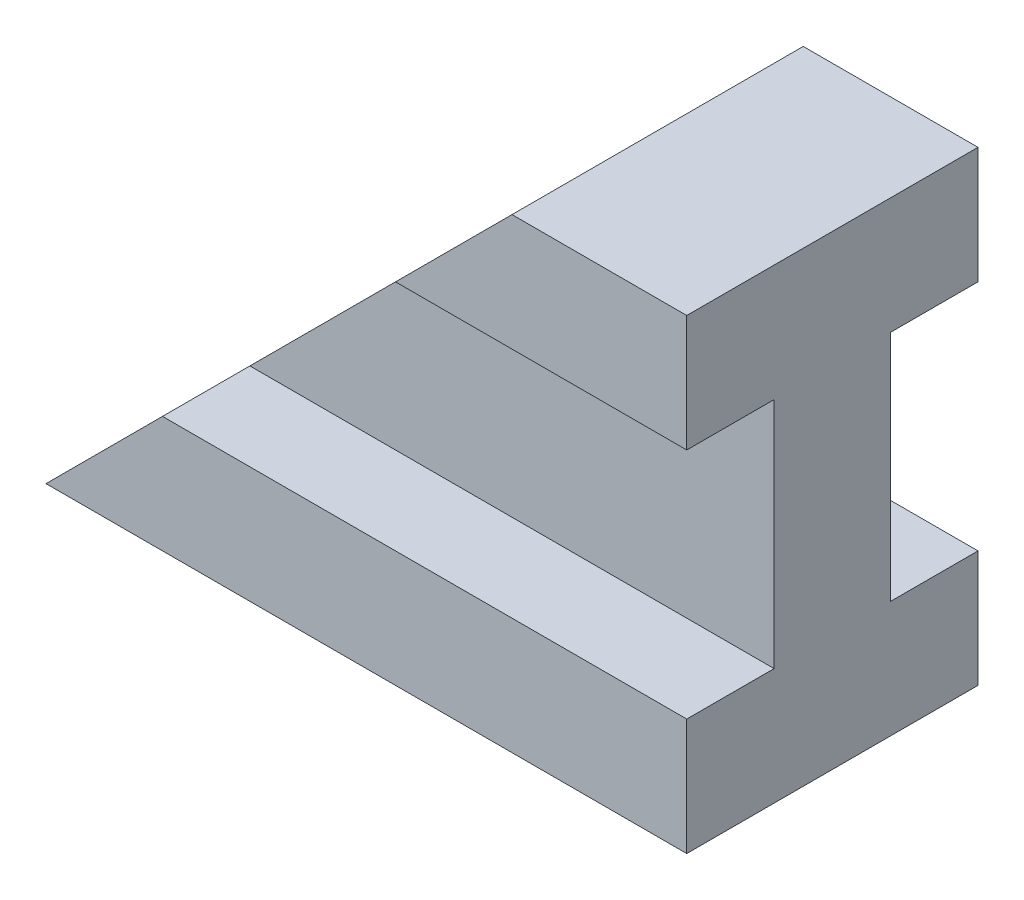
ISO-10303-21;
HEADER;
FILE_DESCRIPTION(('STEP AP214'),'2;1');
FILE_NAME('part.step','',(''),(''),'','','');
FILE_SCHEMA(('AUTOMOTIVE_DESIGN { 1 0 10303 214 1 1 1 1 }'));
ENDSEC;
DATA;
#1=APPLICATION_CONTEXT('core data for automotive mechanical design processes');
#2=APPLICATION_PROTOCOL_DEFINITION('international standard','automotive_design',2000,#1);
#3=PRODUCT_CONTEXT('',#1,'mechanical');
#4=PRODUCT('Part','Part','',(#3));
#5=PRODUCT_RELATED_PRODUCT_CATEGORY('part','',(#4));
#6=PRODUCT_DEFINITION_FORMATION('','',#4);
#7=PRODUCT_DEFINITION_CONTEXT('part definition',#1,'design');
#8=PRODUCT_DEFINITION('design','',#6,#7);
#9=PRODUCT_DEFINITION_SHAPE('','',#8);
#10=(LENGTH_UNIT() NAMED_UNIT(*) SI_UNIT(.MILLI.,.METRE.));
#11=(NAMED_UNIT(*) PLANE_ANGLE_UNIT() SI_UNIT($,.RADIAN.));
#12=(NAMED_UNIT(*) SI_UNIT($,.STERADIAN.) SOLID_ANGLE_UNIT());
#13=UNCERTAINTY_MEASURE_WITH_UNIT(LENGTH_MEASURE(1.E-05),#10,'distance_accuracy_value','');
#14=(GEOMETRIC_REPRESENTATION_CONTEXT(3) GLOBAL_UNCERTAINTY_ASSIGNED_CONTEXT((#13)) GLOBAL_UNIT_ASSIGNED_CONTEXT((#10,
#11,#12)) REPRESENTATION_CONTEXT('',''));
#15=CARTESIAN_POINT('',(0.,0.,0.));
#16=DIRECTION('',(0.,0.,1.));
#17=DIRECTION('',(1.,0.,0.));
#18=AXIS2_PLACEMENT_3D('',#15,#16,#17);
#19=CARTESIAN_POINT('',(110.,110.,0.));
#20=DIRECTION('',(0.,0.,-1.));
#21=DIRECTION('',(-1.,0.,0.));
#22=AXIS2_PLACEMENT_3D('',#19,#20,#21);
#23=PLANE('',#22);
#24=DIRECTION('',(1.,0.,0.));
#25=VECTOR('',#24,1.);
#26=CARTESIAN_POINT('',(110.,60.,0.));
#27=LINE('',#26,#25);
#28=CARTESIAN_POINT('',(60.,60.,0.));
#29=VERTEX_POINT('',#28);
#30=CARTESIAN_POINT('',(110.,60.,0.));
#31=VERTEX_POINT('',#30);
#32=EDGE_CURVE('E11',#29,#31,#27,.T.);
#33=ORIENTED_EDGE('',*,*,#32,.F.);
#34=DIRECTION('',(-0.707106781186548,-0.707106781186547,0.));
#35=VECTOR('',#34,1.);
#36=CARTESIAN_POINT('',(80.,80.,0.));
#37=LINE('',#36,#35);
#38=CARTESIAN_POINT('',(80.,80.,0.));
#39=VERTEX_POINT('',#38);
#40=EDGE_CURVE('E184',#39,#29,#37,.T.);
#41=ORIENTED_EDGE('',*,*,#40,.F.);
#42=DIRECTION('',(-1.,0.,0.));
#43=VECTOR('',#42,1.);
#44=CARTESIAN_POINT('',(110.,80.,0.));
#45=LINE('',#44,#43);
#46=CARTESIAN_POINT('',(110.,80.,0.));
#47=VERTEX_POINT('',#46);
#48=EDGE_CURVE('E192',#47,#39,#45,.T.);
#49=ORIENTED_EDGE('',*,*,#48,.F.);
#50=DIRECTION('',(0.,1.,0.));
#51=VECTOR('',#50,1.);
#52=CARTESIAN_POINT('',(110.,0.,0.));
#53=LINE('',#52,#51);
#54=EDGE_CURVE('E189',#31,#47,#53,.T.);
#55=ORIENTED_EDGE('',*,*,#54,.F.);
#56=EDGE_LOOP('',(#33,#41,#49,#55));
#57=FACE_BOUND('',#56,.T.);
#58=ADVANCED_FACE('F31',(#57),#23,.T.);
#59=CARTESIAN_POINT('',(110.,110.,50.));
#60=DIRECTION('',(0.,0.,-1.));
#61=DIRECTION('',(-1.,0.,0.));
#62=AXIS2_PLACEMENT_3D('',#59,#60,#61);
#63=PLANE('',#62);
#64=DIRECTION('',(-0.707106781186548,-0.707106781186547,0.));
#65=VECTOR('',#64,1.);
#66=CARTESIAN_POINT('',(80.,80.,50.));
#67=LINE('',#66,#65);
#68=CARTESIAN_POINT('',(80.,80.,50.));
#69=VERTEX_POINT('',#68);
#70=CARTESIAN_POINT('',(60.,60.,50.));
#71=VERTEX_POINT('',#70);
#72=EDGE_CURVE('E171',#69,#71,#67,.T.);
#73=ORIENTED_EDGE('',*,*,#72,.T.);
#74=DIRECTION('',(1.,0.,0.));
#75=VECTOR('',#74,1.);
#76=CARTESIAN_POINT('',(110.,60.,50.));
#77=LINE('',#76,#75);
#78=CARTESIAN_POINT('',(110.,60.,50.));
#79=VERTEX_POINT('',#78);
#80=EDGE_CURVE('E207',#71,#79,#77,.T.);
#81=ORIENTED_EDGE('',*,*,#80,.T.);
#82=DIRECTION('',(0.,1.,0.));
#83=VECTOR('',#82,1.);
#84=CARTESIAN_POINT('',(110.,0.,50.));
#85=LINE('',#84,#83);
#86=CARTESIAN_POINT('',(110.,80.,50.));
#87=VERTEX_POINT('',#86);
#88=EDGE_CURVE('E177',#79,#87,#85,.T.);
#89=ORIENTED_EDGE('',*,*,#88,.T.);
#90=DIRECTION('',(-1.,0.,0.));
#91=VECTOR('',#90,1.);
#92=CARTESIAN_POINT('',(110.,80.,50.));
#93=LINE('',#92,#91);
#94=EDGE_CURVE('E181',#87,#69,#93,.T.);
#95=ORIENTED_EDGE('',*,*,#94,.T.);
#96=EDGE_LOOP('',(#73,#81,#89,#95));
#97=FACE_BOUND('',#96,.T.);
#98=ADVANCED_FACE('F236',(#97),#63,.F.);
#99=CARTESIAN_POINT('',(80.,80.,50.));
#100=DIRECTION('',(0.707106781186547,-0.707106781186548,0.));
#101=DIRECTION('',(0.707106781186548,0.707106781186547,0.));
#102=AXIS2_PLACEMENT_3D('',#99,#100,#101);
#103=PLANE('',#102);
#104=ORIENTED_EDGE('',*,*,#40,.T.);
#105=DIRECTION('',(0.,0.,1.));
#106=VECTOR('',#105,1.);
#107=CARTESIAN_POINT('',(60.,60.,50.));
#108=LINE('',#107,#106);
#109=CARTESIAN_POINT('',(60.,60.,15.));
#110=VERTEX_POINT('',#109);
#111=EDGE_CURVE('E148',#29,#110,#108,.T.);
#112=ORIENTED_EDGE('',*,*,#111,.T.);
#113=DIRECTION('',(-0.707106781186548,-0.707106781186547,0.));
#114=VECTOR('',#113,1.);
#115=CARTESIAN_POINT('',(80.,80.,15.));
#116=LINE('',#115,#114);
#117=CARTESIAN_POINT('',(20.,20.,15.));
#118=VERTEX_POINT('',#117);
#119=EDGE_CURVE('E127',#110,#118,#116,.T.);
#120=ORIENTED_EDGE('',*,*,#119,.T.);
#121=DIRECTION('',(0.,0.,-1.));
#122=VECTOR('',#121,1.);
#123=CARTESIAN_POINT('',(20.,20.,50.));
#124=LINE('',#123,#122);
#125=CARTESIAN_POINT('',(20.,20.,0.));
#126=VERTEX_POINT('',#125);
#127=EDGE_CURVE('E144',#118,#126,#124,.T.);
#128=ORIENTED_EDGE('',*,*,#127,.T.);
#129=CARTESIAN_POINT('',(0.,0.,0.));
#130=VERTEX_POINT('',#129);
#131=EDGE_CURVE('E170',#126,#130,#37,.T.);
#132=ORIENTED_EDGE('',*,*,#131,.T.);
#133=DIRECTION('',(0.,0.,-1.));
#134=VECTOR('',#133,1.);
#135=CARTESIAN_POINT('',(0.,0.,50.));
#136=LINE('',#135,#134);
#137=CARTESIAN_POINT('',(0.,0.,50.));
#138=VERTEX_POINT('',#137);
#139=EDGE_CURVE('E202',#138,#130,#136,.T.);
#140=ORIENTED_EDGE('',*,*,#139,.F.);
#141=CARTESIAN_POINT('',(20.,20.,50.));
#142=VERTEX_POINT('',#141);
#143=EDGE_CURVE('E175',#142,#138,#67,.T.);
#144=ORIENTED_EDGE('',*,*,#143,.F.);
#145=DIRECTION('',(0.,0.,-1.));
#146=VECTOR('',#145,1.);
#147=CARTESIAN_POINT('',(20.,20.,50.));
#148=LINE('',#147,#146);
#149=CARTESIAN_POINT('',(20.,20.,35.));
#150=VERTEX_POINT('',#149);
#151=EDGE_CURVE('E54',#142,#150,#148,.T.);
#152=ORIENTED_EDGE('',*,*,#151,.T.);
#153=DIRECTION('',(0.707106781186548,0.707106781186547,0.));
#154=VECTOR('',#153,1.);
#155=CARTESIAN_POINT('',(80.,80.,35.));
#156=LINE('',#155,#154);
#157=CARTESIAN_POINT('',(60.,60.,35.));
#158=VERTEX_POINT('',#157);
#159=EDGE_CURVE('E167',#150,#158,#156,.T.);
#160=ORIENTED_EDGE('',*,*,#159,.T.);
#161=DIRECTION('',(0.,0.,1.));
#162=VECTOR('',#161,1.);
#163=CARTESIAN_POINT('',(60.,60.,50.));
#164=LINE('',#163,#162);
#165=EDGE_CURVE('E164',#158,#71,#164,.T.);
#166=ORIENTED_EDGE('',*,*,#165,.T.);
#167=ORIENTED_EDGE('',*,*,#72,.F.);
#168=DIRECTION('',(0.,0.,-1.));
#169=VECTOR('',#168,1.);
#170=CARTESIAN_POINT('',(80.,80.,50.));
#171=LINE('',#170,#169);
#172=EDGE_CURVE('E183',#69,#39,#171,.T.);
#173=ORIENTED_EDGE('',*,*,#172,.T.);
#174=EDGE_LOOP('',(#104,#112,#120,#128,#132,#140,#144,#152,#160,#166,#167,#173));
#175=FACE_BOUND('',#174,.T.);
#176=ADVANCED_FACE('F33',(#175),#103,.F.);
#177=CARTESIAN_POINT('',(0.,0.,50.));
#178=DIRECTION('',(0.,1.,0.));
#179=DIRECTION('',(0.,0.,1.));
#180=AXIS2_PLACEMENT_3D('',#177,#178,#179);
#181=PLANE('',#180);
#182=DIRECTION('',(1.,0.,0.));
#183=VECTOR('',#182,1.);
#184=CARTESIAN_POINT('',(0.,0.,0.));
#185=LINE('',#184,#183);
#186=CARTESIAN_POINT('',(110.,0.,0.));
#187=VERTEX_POINT('',#186);
#188=EDGE_CURVE('E187',#130,#187,#185,.T.);
#189=ORIENTED_EDGE('',*,*,#188,.T.);
#190=DIRECTION('',(0.,0.,-1.));
#191=VECTOR('',#190,1.);
#192=CARTESIAN_POINT('',(110.,0.,50.));
#193=LINE('',#192,#191);
#194=CARTESIAN_POINT('',(110.,0.,50.));
#195=VERTEX_POINT('',#194);
#196=EDGE_CURVE('E199',#195,#187,#193,.T.);
#197=ORIENTED_EDGE('',*,*,#196,.F.);
#198=DIRECTION('',(1.,0.,0.));
#199=VECTOR('',#198,1.);
#200=CARTESIAN_POINT('',(0.,0.,50.));
#201=LINE('',#200,#199);
#202=EDGE_CURVE('E174',#138,#195,#201,.T.);
#203=ORIENTED_EDGE('',*,*,#202,.F.);
#204=ORIENTED_EDGE('',*,*,#139,.T.);
#205=EDGE_LOOP('',(#189,#197,#203,#204));
#206=FACE_BOUND('',#205,.T.);
#207=ADVANCED_FACE('F220',(#206),#181,.F.);
#208=CARTESIAN_POINT('',(110.,0.,50.));
#209=DIRECTION('',(-1.,0.,0.));
#210=DIRECTION('',(0.,0.,1.));
#211=AXIS2_PLACEMENT_3D('',#208,#209,#210);
#212=PLANE('',#211);
#213=DIRECTION('',(0.,-1.,0.));
#214=VECTOR('',#213,1.);
#215=CARTESIAN_POINT('',(110.,60.,15.));
#216=LINE('',#215,#214);
#217=CARTESIAN_POINT('',(110.,60.,15.));
#218=VERTEX_POINT('',#217);
#219=CARTESIAN_POINT('',(110.,20.,15.));
#220=VERTEX_POINT('',#219);
#221=EDGE_CURVE('E125',#218,#220,#216,.T.);
#222=ORIENTED_EDGE('',*,*,#221,.F.);
#223=DIRECTION('',(0.,0.,1.));
#224=VECTOR('',#223,1.);
#225=CARTESIAN_POINT('',(110.,60.,0.));
#226=LINE('',#225,#224);
#227=EDGE_CURVE('E133',#31,#218,#226,.T.);
#228=ORIENTED_EDGE('',*,*,#227,.F.);
#229=ORIENTED_EDGE('',*,*,#54,.T.);
#230=DIRECTION('',(0.,0.,-1.));
#231=VECTOR('',#230,1.);
#232=CARTESIAN_POINT('',(110.,80.,50.));
#233=LINE('',#232,#231);
#234=EDGE_CURVE('E196',#87,#47,#233,.T.);
#235=ORIENTED_EDGE('',*,*,#234,.F.);
#236=ORIENTED_EDGE('',*,*,#88,.F.);
#237=DIRECTION('',(0.,0.,1.));
#238=VECTOR('',#237,1.);
#239=CARTESIAN_POINT('',(110.,60.,50.));
#240=LINE('',#239,#238);
#241=CARTESIAN_POINT('',(110.,60.,35.));
#242=VERTEX_POINT('',#241);
#243=EDGE_CURVE('E157',#242,#79,#240,.T.);
#244=ORIENTED_EDGE('',*,*,#243,.F.);
#245=DIRECTION('',(0.,1.,0.));
#246=VECTOR('',#245,1.);
#247=CARTESIAN_POINT('',(110.,60.,35.));
#248=LINE('',#247,#246);
#249=CARTESIAN_POINT('',(110.,20.,35.));
#250=VERTEX_POINT('',#249);
#251=EDGE_CURVE('E154',#250,#242,#248,.T.);
#252=ORIENTED_EDGE('',*,*,#251,.F.);
#253=DIRECTION('',(0.,0.,-1.));
#254=VECTOR('',#253,1.);
#255=CARTESIAN_POINT('',(110.,20.,50.));
#256=LINE('',#255,#254);
#257=CARTESIAN_POINT('',(110.,20.,50.));
#258=VERTEX_POINT('',#257);
#259=EDGE_CURVE('E151',#258,#250,#256,.T.);
#260=ORIENTED_EDGE('',*,*,#259,.F.);
#261=EDGE_CURVE('E178',#195,#258,#85,.T.);
#262=ORIENTED_EDGE('',*,*,#261,.F.);
#263=ORIENTED_EDGE('',*,*,#196,.T.);
#264=CARTESIAN_POINT('',(110.,20.,0.));
#265=VERTEX_POINT('',#264);
#266=EDGE_CURVE('E190',#187,#265,#53,.T.);
#267=ORIENTED_EDGE('',*,*,#266,.T.);
#268=DIRECTION('',(0.,0.,-1.));
#269=VECTOR('',#268,1.);
#270=CARTESIAN_POINT('',(110.,20.,0.));
#271=LINE('',#270,#269);
#272=EDGE_CURVE('E46',#220,#265,#271,.T.);
#273=ORIENTED_EDGE('',*,*,#272,.F.);
#274=EDGE_LOOP('',(#222,#228,#229,#235,#236,#244,#252,#260,#262,#263,#267,#273));
#275=FACE_BOUND('',#274,.T.);
#276=ADVANCED_FACE('F139',(#275),#212,.F.);
#277=CARTESIAN_POINT('',(110.,80.,50.));
#278=DIRECTION('',(0.,-1.,0.));
#279=DIRECTION('',(0.,0.,-1.));
#280=AXIS2_PLACEMENT_3D('',#277,#278,#279);
#281=PLANE('',#280);
#282=ORIENTED_EDGE('',*,*,#48,.T.);
#283=ORIENTED_EDGE('',*,*,#172,.F.);
#284=ORIENTED_EDGE('',*,*,#94,.F.);
#285=ORIENTED_EDGE('',*,*,#234,.T.);
#286=EDGE_LOOP('',(#282,#283,#284,#285));
#287=FACE_BOUND('',#286,.T.);
#288=ADVANCED_FACE('F241',(#287),#281,.F.);
#289=ORIENTED_EDGE('',*,*,#261,.T.);
#290=DIRECTION('',(-1.,0.,0.));
#291=VECTOR('',#290,1.);
#292=CARTESIAN_POINT('',(110.,20.,50.));
#293=LINE('',#292,#291);
#294=EDGE_CURVE('E205',#258,#142,#293,.T.);
#295=ORIENTED_EDGE('',*,*,#294,.T.);
#296=ORIENTED_EDGE('',*,*,#143,.T.);
#297=ORIENTED_EDGE('',*,*,#202,.T.);
#298=EDGE_LOOP('',(#289,#295,#296,#297));
#299=FACE_BOUND('',#298,.T.);
#300=ADVANCED_FACE('F223',(#299),#63,.F.);
#301=DIRECTION('',(-1.,0.,0.));
#302=VECTOR('',#301,1.);
#303=CARTESIAN_POINT('',(110.,20.,0.));
#304=LINE('',#303,#302);
#305=EDGE_CURVE('E39',#265,#126,#304,.T.);
#306=ORIENTED_EDGE('',*,*,#305,.F.);
#307=ORIENTED_EDGE('',*,*,#266,.F.);
#308=ORIENTED_EDGE('',*,*,#188,.F.);
#309=ORIENTED_EDGE('',*,*,#131,.F.);
#310=EDGE_LOOP('',(#306,#307,#308,#309));
#311=FACE_BOUND('',#310,.T.);
#312=ADVANCED_FACE('F216',(#311),#23,.T.);
#313=CARTESIAN_POINT('',(0.,60.,35.));
#314=DIRECTION('',(0.,0.,-1.));
#315=DIRECTION('',(0.,1.,0.));
#316=AXIS2_PLACEMENT_3D('',#313,#314,#315);
#317=PLANE('',#316);
#318=DIRECTION('',(1.,0.,0.));
#319=VECTOR('',#318,1.);
#320=CARTESIAN_POINT('',(0.,20.,35.));
#321=LINE('',#320,#319);
#322=EDGE_CURVE('E159',#150,#250,#321,.T.);
#323=ORIENTED_EDGE('',*,*,#322,.T.);
#324=ORIENTED_EDGE('',*,*,#251,.T.);
#325=DIRECTION('',(1.,0.,0.));
#326=VECTOR('',#325,1.);
#327=CARTESIAN_POINT('',(0.,60.,35.));
#328=LINE('',#327,#326);
#329=EDGE_CURVE('E160',#158,#242,#328,.T.);
#330=ORIENTED_EDGE('',*,*,#329,.F.);
#331=ORIENTED_EDGE('',*,*,#159,.F.);
#332=EDGE_LOOP('',(#323,#324,#330,#331));
#333=FACE_BOUND('',#332,.T.);
#334=ADVANCED_FACE('F232',(#333),#317,.F.);
#335=CARTESIAN_POINT('',(0.,60.,50.));
#336=DIRECTION('',(0.,1.,0.));
#337=DIRECTION('',(0.,0.,1.));
#338=AXIS2_PLACEMENT_3D('',#335,#336,#337);
#339=PLANE('',#338);
#340=ORIENTED_EDGE('',*,*,#329,.T.);
#341=ORIENTED_EDGE('',*,*,#243,.T.);
#342=ORIENTED_EDGE('',*,*,#80,.F.);
#343=ORIENTED_EDGE('',*,*,#165,.F.);
#344=EDGE_LOOP('',(#340,#341,#342,#343));
#345=FACE_BOUND('',#344,.T.);
#346=ADVANCED_FACE('F257',(#345),#339,.F.);
#347=CARTESIAN_POINT('',(0.,20.,50.));
#348=DIRECTION('',(0.,-1.,0.));
#349=DIRECTION('',(0.,0.,-1.));
#350=AXIS2_PLACEMENT_3D('',#347,#348,#349);
#351=PLANE('',#350);
#352=ORIENTED_EDGE('',*,*,#294,.F.);
#353=ORIENTED_EDGE('',*,*,#259,.T.);
#354=ORIENTED_EDGE('',*,*,#322,.F.);
#355=ORIENTED_EDGE('',*,*,#151,.F.);
#356=EDGE_LOOP('',(#352,#353,#354,#355));
#357=FACE_BOUND('',#356,.T.);
#358=ADVANCED_FACE('F226',(#357),#351,.F.);
#359=CARTESIAN_POINT('',(0.,60.,15.));
#360=DIRECTION('',(0.,0.,1.));
#361=DIRECTION('',(0.,-1.,0.));
#362=AXIS2_PLACEMENT_3D('',#359,#360,#361);
#363=PLANE('',#362);
#364=DIRECTION('',(1.,0.,0.));
#365=VECTOR('',#364,1.);
#366=CARTESIAN_POINT('',(0.,60.,15.));
#367=LINE('',#366,#365);
#368=EDGE_CURVE('E120',#110,#218,#367,.T.);
#369=ORIENTED_EDGE('',*,*,#368,.T.);
#370=ORIENTED_EDGE('',*,*,#221,.T.);
#371=DIRECTION('',(1.,0.,0.));
#372=VECTOR('',#371,1.);
#373=CARTESIAN_POINT('',(0.,20.,15.));
#374=LINE('',#373,#372);
#375=EDGE_CURVE('E130',#118,#220,#374,.T.);
#376=ORIENTED_EDGE('',*,*,#375,.F.);
#377=ORIENTED_EDGE('',*,*,#119,.F.);
#378=EDGE_LOOP('',(#369,#370,#376,#377));
#379=FACE_BOUND('',#378,.T.);
#380=ADVANCED_FACE('F122',(#379),#363,.F.);
#381=CARTESIAN_POINT('',(0.,60.,0.));
#382=DIRECTION('',(0.,1.,0.));
#383=DIRECTION('',(0.,0.,1.));
#384=AXIS2_PLACEMENT_3D('',#381,#382,#383);
#385=PLANE('',#384);
#386=ORIENTED_EDGE('',*,*,#32,.T.);
#387=ORIENTED_EDGE('',*,*,#227,.T.);
#388=ORIENTED_EDGE('',*,*,#368,.F.);
#389=ORIENTED_EDGE('',*,*,#111,.F.);
#390=EDGE_LOOP('',(#386,#387,#388,#389));
#391=FACE_BOUND('',#390,.T.);
#392=ADVANCED_FACE('F134',(#391),#385,.F.);
#393=CARTESIAN_POINT('',(0.,20.,0.));
#394=DIRECTION('',(0.,-1.,0.));
#395=DIRECTION('',(0.,0.,-1.));
#396=AXIS2_PLACEMENT_3D('',#393,#394,#395);
#397=PLANE('',#396);
#398=ORIENTED_EDGE('',*,*,#375,.T.);
#399=ORIENTED_EDGE('',*,*,#272,.T.);
#400=ORIENTED_EDGE('',*,*,#305,.T.);
#401=ORIENTED_EDGE('',*,*,#127,.F.);
#402=EDGE_LOOP('',(#398,#399,#400,#401));
#403=FACE_BOUND('',#402,.T.);
#404=ADVANCED_FACE('F209',(#403),#397,.F.);
#405=CLOSED_SHELL('',(#58,#98,#176,#207,#276,#288,#300,#312,#334,#346,#358,#380,#392,#404));
#406=MANIFOLD_SOLID_BREP('B2',#405);
#407=ADVANCED_BREP_SHAPE_REPRESENTATION('',(#18,#406),#14);
#408=SHAPE_DEFINITION_REPRESENTATION(#9,#407);
ENDSEC;
END-ISO-10303-21;
